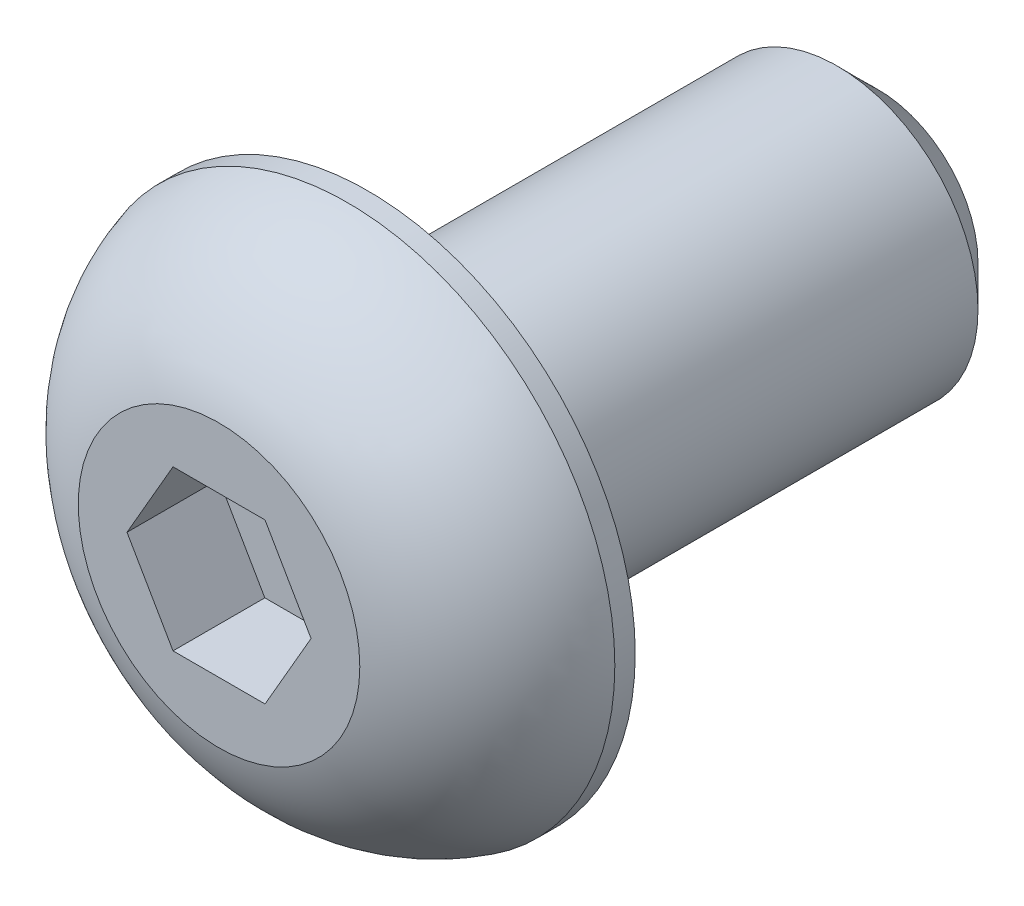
ISO-10303-21;
HEADER;
FILE_DESCRIPTION(('STEP AP214'),'2;1');
FILE_NAME('part.step','',(''),(''),'','','');
FILE_SCHEMA(('AUTOMOTIVE_DESIGN { 1 0 10303 214 1 1 1 1 }'));
ENDSEC;
DATA;
#1=APPLICATION_CONTEXT('core data for automotive mechanical design processes');
#2=APPLICATION_PROTOCOL_DEFINITION('international standard','automotive_design',2000,#1);
#3=PRODUCT_CONTEXT('',#1,'mechanical');
#4=PRODUCT('Part','Part','',(#3));
#5=PRODUCT_RELATED_PRODUCT_CATEGORY('part','',(#4));
#6=PRODUCT_DEFINITION_FORMATION('','',#4);
#7=PRODUCT_DEFINITION_CONTEXT('part definition',#1,'design');
#8=PRODUCT_DEFINITION('design','',#6,#7);
#9=PRODUCT_DEFINITION_SHAPE('','',#8);
#10=(LENGTH_UNIT() NAMED_UNIT(*) SI_UNIT(.MILLI.,.METRE.));
#11=(NAMED_UNIT(*) PLANE_ANGLE_UNIT() SI_UNIT($,.RADIAN.));
#12=(NAMED_UNIT(*) SI_UNIT($,.STERADIAN.) SOLID_ANGLE_UNIT());
#13=UNCERTAINTY_MEASURE_WITH_UNIT(LENGTH_MEASURE(1.E-05),#10,'distance_accuracy_value','');
#14=(GEOMETRIC_REPRESENTATION_CONTEXT(3) GLOBAL_UNCERTAINTY_ASSIGNED_CONTEXT((#13)) GLOBAL_UNIT_ASSIGNED_CONTEXT((#10,
#11,#12)) REPRESENTATION_CONTEXT('',''));
#15=CARTESIAN_POINT('',(0.,0.,0.));
#16=DIRECTION('',(0.,0.,1.));
#17=DIRECTION('',(1.,0.,0.));
#18=AXIS2_PLACEMENT_3D('',#15,#16,#17);
#19=CARTESIAN_POINT('',(0.,0.,-6.35));
#20=DIRECTION('',(0.,0.,1.));
#21=DIRECTION('',(1.,0.,0.));
#22=AXIS2_PLACEMENT_3D('',#19,#20,#21);
#23=CONICAL_SURFACE('',#22,1.2446,0.785398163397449);
#24=CARTESIAN_POINT('',(0.,0.,-5.842));
#25=DIRECTION('',(0.,0.,1.));
#26=DIRECTION('',(1.,0.,0.));
#27=AXIS2_PLACEMENT_3D('',#24,#25,#26);
#28=CIRCLE('',#27,1.7526);
#29=CARTESIAN_POINT('',(1.7526,0.,-5.842));
#30=VERTEX_POINT('',#29);
#31=EDGE_CURVE('E11',#30,#30,#28,.T.);
#32=ORIENTED_EDGE('',*,*,#31,.F.);
#33=EDGE_LOOP('',(#32));
#34=FACE_BOUND('',#33,.T.);
#35=CARTESIAN_POINT('',(0.,0.,-6.35));
#36=DIRECTION('',(0.,0.,1.));
#37=DIRECTION('',(1.,0.,0.));
#38=AXIS2_PLACEMENT_3D('',#35,#36,#37);
#39=CIRCLE('',#38,1.2446);
#40=CARTESIAN_POINT('',(1.2446,0.,-6.35));
#41=VERTEX_POINT('',#40);
#42=EDGE_CURVE('E133',#41,#41,#39,.T.);
#43=ORIENTED_EDGE('',*,*,#42,.T.);
#44=EDGE_LOOP('',(#43));
#45=FACE_BOUND('',#44,.T.);
#46=ADVANCED_FACE('F32',(#34,#45),#23,.T.);
#47=CARTESIAN_POINT('',(0.,0.,3.15095221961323));
#48=DIRECTION('',(0.,0.,1.));
#49=DIRECTION('',(1.,0.,0.));
#50=AXIS2_PLACEMENT_3D('',#47,#48,#49);
#51=CYLINDRICAL_SURFACE('',#50,1.7526);
#52=CARTESIAN_POINT('',(0.,0.,0.));
#53=DIRECTION('',(0.,0.,1.));
#54=DIRECTION('',(1.,0.,0.));
#55=AXIS2_PLACEMENT_3D('',#52,#53,#54);
#56=CIRCLE('',#55,1.7526);
#57=CARTESIAN_POINT('',(1.7526,0.,0.));
#58=VERTEX_POINT('',#57);
#59=EDGE_CURVE('E39',#58,#58,#56,.T.);
#60=ORIENTED_EDGE('',*,*,#59,.F.);
#61=EDGE_LOOP('',(#60));
#62=FACE_BOUND('',#61,.T.);
#63=ORIENTED_EDGE('',*,*,#31,.T.);
#64=EDGE_LOOP('',(#63));
#65=FACE_BOUND('',#64,.T.);
#66=ADVANCED_FACE('F154',(#62,#65),#51,.T.);
#67=CARTESIAN_POINT('',(0.,1.7526,0.));
#68=DIRECTION('',(0.,0.,1.));
#69=DIRECTION('',(1.,0.,0.));
#70=AXIS2_PLACEMENT_3D('',#67,#68,#69);
#71=PLANE('',#70);
#72=CARTESIAN_POINT('',(0.,0.,0.));
#73=DIRECTION('',(0.,0.,1.));
#74=DIRECTION('',(1.,0.,0.));
#75=AXIS2_PLACEMENT_3D('',#72,#73,#74);
#76=CIRCLE('',#75,3.3274);
#77=CARTESIAN_POINT('',(3.3274,0.,0.));
#78=VERTEX_POINT('',#77);
#79=EDGE_CURVE('E147',#78,#78,#76,.T.);
#80=ORIENTED_EDGE('',*,*,#79,.F.);
#81=EDGE_LOOP('',(#80));
#82=FACE_BOUND('',#81,.T.);
#83=ORIENTED_EDGE('',*,*,#59,.T.);
#84=EDGE_LOOP('',(#83));
#85=FACE_BOUND('',#84,.T.);
#86=ADVANCED_FACE('F152',(#82,#85),#71,.F.);
#87=CARTESIAN_POINT('',(0.,0.,3.15095221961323));
#88=DIRECTION('',(0.,0.,1.));
#89=DIRECTION('',(1.,0.,0.));
#90=AXIS2_PLACEMENT_3D('',#87,#88,#89);
#91=CYLINDRICAL_SURFACE('',#90,3.3274);
#92=CARTESIAN_POINT('',(0.,0.,0.254));
#93=DIRECTION('',(0.,0.,1.));
#94=DIRECTION('',(1.,0.,0.));
#95=AXIS2_PLACEMENT_3D('',#92,#93,#94);
#96=CIRCLE('',#95,3.3274);
#97=CARTESIAN_POINT('',(3.3274,0.,0.254));
#98=VERTEX_POINT('',#97);
#99=EDGE_CURVE('E144',#98,#98,#96,.T.);
#100=ORIENTED_EDGE('',*,*,#99,.F.);
#101=EDGE_LOOP('',(#100));
#102=FACE_BOUND('',#101,.T.);
#103=ORIENTED_EDGE('',*,*,#79,.T.);
#104=EDGE_LOOP('',(#103));
#105=FACE_BOUND('',#104,.T.);
#106=ADVANCED_FACE('F181',(#102,#105),#91,.T.);
#107=CARTESIAN_POINT('',(0.,0.,-0.342716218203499));
#108=DIRECTION('',(0.,0.,1.));
#109=DIRECTION('',(1.,0.,0.));
#110=AXIS2_PLACEMENT_3D('',#107,#108,#109);
#111=DEGENERATE_TOROIDAL_SURFACE('',#110,1.12065448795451,2.286,.T.);
#112=CARTESIAN_POINT('',(0.,0.,1.8542));
#113=DIRECTION('',(0.,0.,1.));
#114=DIRECTION('',(1.,0.,0.));
#115=AXIS2_PLACEMENT_3D('',#112,#113,#114);
#116=CIRCLE('',#115,1.7526);
#117=CARTESIAN_POINT('',(1.7526,0.,1.8542));
#118=VERTEX_POINT('',#117);
#119=EDGE_CURVE('E141',#118,#118,#116,.T.);
#120=ORIENTED_EDGE('',*,*,#119,.F.);
#121=EDGE_LOOP('',(#120));
#122=FACE_BOUND('',#121,.T.);
#123=ORIENTED_EDGE('',*,*,#99,.T.);
#124=EDGE_LOOP('',(#123));
#125=FACE_BOUND('',#124,.T.);
#126=ADVANCED_FACE('F174',(#122,#125),#111,.T.);
#127=CARTESIAN_POINT('',(0.,1.7526,1.8542));
#128=DIRECTION('',(0.,0.,-1.));
#129=DIRECTION('',(-1.,0.,0.));
#130=AXIS2_PLACEMENT_3D('',#127,#128,#129);
#131=PLANE('',#130);
#132=DIRECTION('',(1.,0.,0.));
#133=VECTOR('',#132,1.);
#134=CARTESIAN_POINT('',(-0.572839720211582,-0.9921875,1.8542));
#135=LINE('',#134,#133);
#136=CARTESIAN_POINT('',(-0.572839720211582,-0.9921875,1.8542));
#137=VERTEX_POINT('',#136);
#138=CARTESIAN_POINT('',(0.572839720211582,-0.9921875,1.8542));
#139=VERTEX_POINT('',#138);
#140=EDGE_CURVE('E120',#137,#139,#135,.T.);
#141=ORIENTED_EDGE('',*,*,#140,.F.);
#142=DIRECTION('',(0.5,-0.866025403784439,0.));
#143=VECTOR('',#142,1.);
#144=CARTESIAN_POINT('',(-1.14567944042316,0.,1.8542));
#145=LINE('',#144,#143);
#146=CARTESIAN_POINT('',(-1.14567944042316,0.,1.8542));
#147=VERTEX_POINT('',#146);
#148=EDGE_CURVE('E46',#147,#137,#145,.T.);
#149=ORIENTED_EDGE('',*,*,#148,.F.);
#150=DIRECTION('',(-0.5,-0.866025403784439,0.));
#151=VECTOR('',#150,1.);
#152=CARTESIAN_POINT('',(-0.572839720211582,0.9921875,1.8542));
#153=LINE('',#152,#151);
#154=CARTESIAN_POINT('',(-0.572839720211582,0.9921875,1.8542));
#155=VERTEX_POINT('',#154);
#156=EDGE_CURVE('E129',#155,#147,#153,.T.);
#157=ORIENTED_EDGE('',*,*,#156,.F.);
#158=DIRECTION('',(-1.,0.,0.));
#159=VECTOR('',#158,1.);
#160=CARTESIAN_POINT('',(0.572839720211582,0.9921875,1.8542));
#161=LINE('',#160,#159);
#162=CARTESIAN_POINT('',(0.572839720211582,0.9921875,1.8542));
#163=VERTEX_POINT('',#162);
#164=EDGE_CURVE('E127',#163,#155,#161,.T.);
#165=ORIENTED_EDGE('',*,*,#164,.F.);
#166=DIRECTION('',(-0.5,0.866025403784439,0.));
#167=VECTOR('',#166,1.);
#168=CARTESIAN_POINT('',(1.14567944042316,0.,1.8542));
#169=LINE('',#168,#167);
#170=CARTESIAN_POINT('',(1.14567944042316,0.,1.8542));
#171=VERTEX_POINT('',#170);
#172=EDGE_CURVE('E94',#171,#163,#169,.T.);
#173=ORIENTED_EDGE('',*,*,#172,.F.);
#174=DIRECTION('',(0.5,0.866025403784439,0.));
#175=VECTOR('',#174,1.);
#176=CARTESIAN_POINT('',(0.572839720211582,-0.9921875,1.8542));
#177=LINE('',#176,#175);
#178=EDGE_CURVE('E123',#139,#171,#177,.T.);
#179=ORIENTED_EDGE('',*,*,#178,.F.);
#180=EDGE_LOOP('',(#141,#149,#157,#165,#173,#179));
#181=FACE_BOUND('',#180,.T.);
#182=ORIENTED_EDGE('',*,*,#119,.T.);
#183=EDGE_LOOP('',(#182));
#184=FACE_BOUND('',#183,.T.);
#185=ADVANCED_FACE('F166',(#181,#184),#131,.F.);
#186=CARTESIAN_POINT('',(0.,0.,-6.35));
#187=DIRECTION('',(0.,0.,1.));
#188=DIRECTION('',(1.,0.,0.));
#189=AXIS2_PLACEMENT_3D('',#186,#187,#188);
#190=PLANE('',#189);
#191=ORIENTED_EDGE('',*,*,#42,.F.);
#192=EDGE_LOOP('',(#191));
#193=FACE_BOUND('',#192,.T.);
#194=ADVANCED_FACE('F163',(#193),#190,.F.);
#195=CARTESIAN_POINT('',(-1.14567944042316,0.,0.7112));
#196=DIRECTION('',(-0.866025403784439,-0.5,0.));
#197=DIRECTION('',(0.5,-0.866025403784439,0.));
#198=AXIS2_PLACEMENT_3D('',#195,#196,#197);
#199=PLANE('',#198);
#200=ORIENTED_EDGE('',*,*,#148,.T.);
#201=DIRECTION('',(0.,0.,1.));
#202=VECTOR('',#201,1.);
#203=CARTESIAN_POINT('',(-0.572839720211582,-0.9921875,0.7112));
#204=LINE('',#203,#202);
#205=CARTESIAN_POINT('',(-0.572839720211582,-0.9921875,0.7112));
#206=VERTEX_POINT('',#205);
#207=EDGE_CURVE('E76',#206,#137,#204,.T.);
#208=ORIENTED_EDGE('',*,*,#207,.F.);
#209=DIRECTION('',(0.5,-0.866025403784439,0.));
#210=VECTOR('',#209,1.);
#211=CARTESIAN_POINT('',(-1.14567944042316,0.,0.7112));
#212=LINE('',#211,#210);
#213=CARTESIAN_POINT('',(-1.14567944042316,0.,0.7112));
#214=VERTEX_POINT('',#213);
#215=EDGE_CURVE('E131',#214,#206,#212,.T.);
#216=ORIENTED_EDGE('',*,*,#215,.F.);
#217=DIRECTION('',(0.,0.,1.));
#218=VECTOR('',#217,1.);
#219=CARTESIAN_POINT('',(-1.14567944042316,0.,0.7112));
#220=LINE('',#219,#218);
#221=EDGE_CURVE('E54',#214,#147,#220,.T.);
#222=ORIENTED_EDGE('',*,*,#221,.T.);
#223=EDGE_LOOP('',(#200,#208,#216,#222));
#224=FACE_BOUND('',#223,.T.);
#225=ADVANCED_FACE('F165',(#224),#199,.F.);
#226=CARTESIAN_POINT('',(-0.572839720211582,0.9921875,0.7112));
#227=DIRECTION('',(-0.866025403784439,0.5,0.));
#228=DIRECTION('',(-0.5,-0.866025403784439,0.));
#229=AXIS2_PLACEMENT_3D('',#226,#227,#228);
#230=PLANE('',#229);
#231=ORIENTED_EDGE('',*,*,#156,.T.);
#232=ORIENTED_EDGE('',*,*,#221,.F.);
#233=DIRECTION('',(-0.5,-0.866025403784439,0.));
#234=VECTOR('',#233,1.);
#235=CARTESIAN_POINT('',(-0.572839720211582,0.9921875,0.7112));
#236=LINE('',#235,#234);
#237=CARTESIAN_POINT('',(-0.572839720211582,0.9921875,0.7112));
#238=VERTEX_POINT('',#237);
#239=EDGE_CURVE('E106',#238,#214,#236,.T.);
#240=ORIENTED_EDGE('',*,*,#239,.F.);
#241=DIRECTION('',(0.,0.,1.));
#242=VECTOR('',#241,1.);
#243=CARTESIAN_POINT('',(-0.572839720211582,0.9921875,0.7112));
#244=LINE('',#243,#242);
#245=EDGE_CURVE('E98',#238,#155,#244,.T.);
#246=ORIENTED_EDGE('',*,*,#245,.T.);
#247=EDGE_LOOP('',(#231,#232,#240,#246));
#248=FACE_BOUND('',#247,.T.);
#249=ADVANCED_FACE('F172',(#248),#230,.F.);
#250=CARTESIAN_POINT('',(0.572839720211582,0.9921875,0.7112));
#251=DIRECTION('',(0.,1.,0.));
#252=DIRECTION('',(-1.,0.,0.));
#253=AXIS2_PLACEMENT_3D('',#250,#251,#252);
#254=PLANE('',#253);
#255=ORIENTED_EDGE('',*,*,#164,.T.);
#256=ORIENTED_EDGE('',*,*,#245,.F.);
#257=DIRECTION('',(-1.,0.,0.));
#258=VECTOR('',#257,1.);
#259=CARTESIAN_POINT('',(0.572839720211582,0.9921875,0.7112));
#260=LINE('',#259,#258);
#261=CARTESIAN_POINT('',(0.572839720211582,0.9921875,0.7112));
#262=VERTEX_POINT('',#261);
#263=EDGE_CURVE('E102',#262,#238,#260,.T.);
#264=ORIENTED_EDGE('',*,*,#263,.F.);
#265=DIRECTION('',(0.,0.,1.));
#266=VECTOR('',#265,1.);
#267=CARTESIAN_POINT('',(0.572839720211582,0.9921875,0.7112));
#268=LINE('',#267,#266);
#269=EDGE_CURVE('E87',#262,#163,#268,.T.);
#270=ORIENTED_EDGE('',*,*,#269,.T.);
#271=EDGE_LOOP('',(#255,#256,#264,#270));
#272=FACE_BOUND('',#271,.T.);
#273=ADVANCED_FACE('F103',(#272),#254,.F.);
#274=CARTESIAN_POINT('',(1.14567944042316,0.,0.7112));
#275=DIRECTION('',(0.866025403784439,0.5,0.));
#276=DIRECTION('',(-0.5,0.866025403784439,0.));
#277=AXIS2_PLACEMENT_3D('',#274,#275,#276);
#278=PLANE('',#277);
#279=ORIENTED_EDGE('',*,*,#172,.T.);
#280=ORIENTED_EDGE('',*,*,#269,.F.);
#281=DIRECTION('',(-0.5,0.866025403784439,0.));
#282=VECTOR('',#281,1.);
#283=CARTESIAN_POINT('',(1.14567944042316,0.,0.7112));
#284=LINE('',#283,#282);
#285=CARTESIAN_POINT('',(1.14567944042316,0.,0.7112));
#286=VERTEX_POINT('',#285);
#287=EDGE_CURVE('E91',#286,#262,#284,.T.);
#288=ORIENTED_EDGE('',*,*,#287,.F.);
#289=DIRECTION('',(0.,0.,1.));
#290=VECTOR('',#289,1.);
#291=CARTESIAN_POINT('',(1.14567944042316,0.,0.7112));
#292=LINE('',#291,#290);
#293=EDGE_CURVE('E99',#286,#171,#292,.T.);
#294=ORIENTED_EDGE('',*,*,#293,.T.);
#295=EDGE_LOOP('',(#279,#280,#288,#294));
#296=FACE_BOUND('',#295,.T.);
#297=ADVANCED_FACE('F89',(#296),#278,.F.);
#298=CARTESIAN_POINT('',(0.572839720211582,-0.9921875,0.7112));
#299=DIRECTION('',(0.866025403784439,-0.5,0.));
#300=DIRECTION('',(0.5,0.866025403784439,0.));
#301=AXIS2_PLACEMENT_3D('',#298,#299,#300);
#302=PLANE('',#301);
#303=ORIENTED_EDGE('',*,*,#178,.T.);
#304=ORIENTED_EDGE('',*,*,#293,.F.);
#305=DIRECTION('',(0.5,0.866025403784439,0.));
#306=VECTOR('',#305,1.);
#307=CARTESIAN_POINT('',(0.572839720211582,-0.9921875,0.7112));
#308=LINE('',#307,#306);
#309=CARTESIAN_POINT('',(0.572839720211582,-0.9921875,0.7112));
#310=VERTEX_POINT('',#309);
#311=EDGE_CURVE('E112',#310,#286,#308,.T.);
#312=ORIENTED_EDGE('',*,*,#311,.F.);
#313=DIRECTION('',(0.,0.,1.));
#314=VECTOR('',#313,1.);
#315=CARTESIAN_POINT('',(0.572839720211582,-0.9921875,0.7112));
#316=LINE('',#315,#314);
#317=EDGE_CURVE('E136',#310,#139,#316,.T.);
#318=ORIENTED_EDGE('',*,*,#317,.T.);
#319=EDGE_LOOP('',(#303,#304,#312,#318));
#320=FACE_BOUND('',#319,.T.);
#321=ADVANCED_FACE('F239',(#320),#302,.F.);
#322=CARTESIAN_POINT('',(-0.572839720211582,-0.9921875,0.7112));
#323=DIRECTION('',(0.,-1.,0.));
#324=DIRECTION('',(1.,0.,0.));
#325=AXIS2_PLACEMENT_3D('',#322,#323,#324);
#326=PLANE('',#325);
#327=ORIENTED_EDGE('',*,*,#140,.T.);
#328=ORIENTED_EDGE('',*,*,#317,.F.);
#329=DIRECTION('',(1.,0.,0.));
#330=VECTOR('',#329,1.);
#331=CARTESIAN_POINT('',(-0.572839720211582,-0.9921875,0.7112));
#332=LINE('',#331,#330);
#333=EDGE_CURVE('E114',#206,#310,#332,.T.);
#334=ORIENTED_EDGE('',*,*,#333,.F.);
#335=ORIENTED_EDGE('',*,*,#207,.T.);
#336=EDGE_LOOP('',(#327,#328,#334,#335));
#337=FACE_BOUND('',#336,.T.);
#338=ADVANCED_FACE('F248',(#337),#326,.F.);
#339=CARTESIAN_POINT('',(0.,0.,0.7112));
#340=DIRECTION('',(0.,0.,1.));
#341=DIRECTION('',(1.,0.,0.));
#342=AXIS2_PLACEMENT_3D('',#339,#340,#341);
#343=PLANE('',#342);
#344=ORIENTED_EDGE('',*,*,#215,.T.);
#345=ORIENTED_EDGE('',*,*,#333,.T.);
#346=ORIENTED_EDGE('',*,*,#311,.T.);
#347=ORIENTED_EDGE('',*,*,#287,.T.);
#348=ORIENTED_EDGE('',*,*,#263,.T.);
#349=ORIENTED_EDGE('',*,*,#239,.T.);
#350=EDGE_LOOP('',(#344,#345,#346,#347,#348,#349));
#351=FACE_BOUND('',#350,.T.);
#352=ADVANCED_FACE('F109',(#351),#343,.T.);
#353=CLOSED_SHELL('',(#46,#66,#86,#106,#126,#185,#194,#225,#249,#273,#297,#321,#338,#352));
#354=MANIFOLD_SOLID_BREP('B2',#353);
#355=ADVANCED_BREP_SHAPE_REPRESENTATION('',(#18,#354),#14);
#356=SHAPE_DEFINITION_REPRESENTATION(#9,#355);
ENDSEC;
END-ISO-10303-21;
